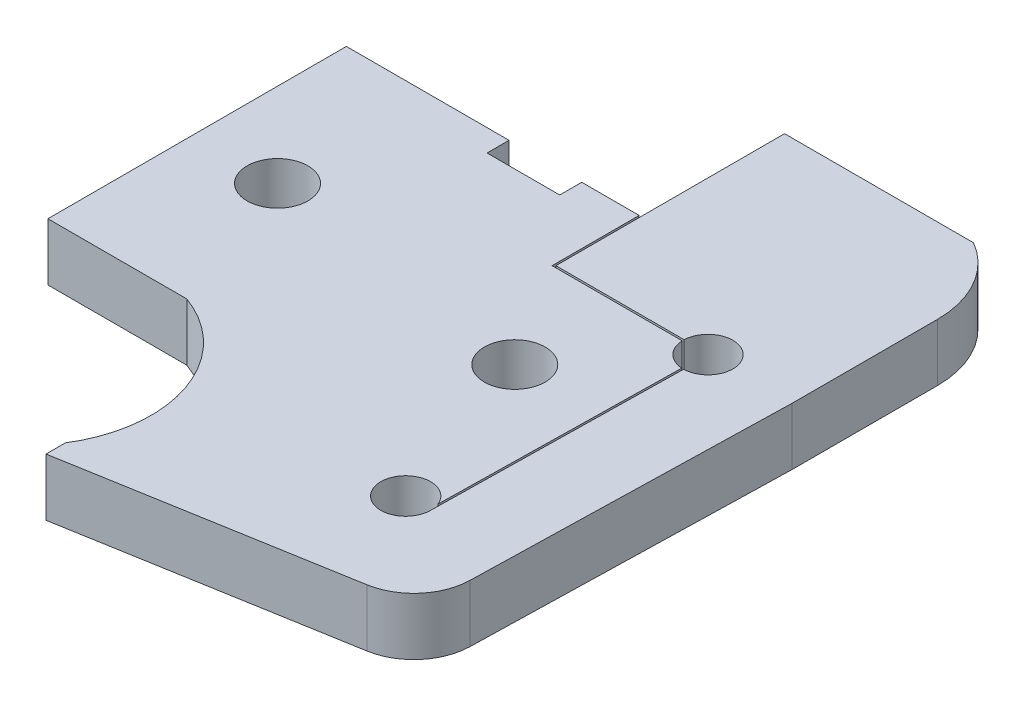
ISO-10303-21;
HEADER;
FILE_DESCRIPTION(('STEP AP214'),'2;1');
FILE_NAME('part.step','',(''),(''),'','','');
FILE_SCHEMA(('AUTOMOTIVE_DESIGN { 1 0 10303 214 1 1 1 1 }'));
ENDSEC;
DATA;
#1=APPLICATION_CONTEXT('core data for automotive mechanical design processes');
#2=APPLICATION_PROTOCOL_DEFINITION('international standard','automotive_design',2000,#1);
#3=PRODUCT_CONTEXT('',#1,'mechanical');
#4=PRODUCT('Part','Part','',(#3));
#5=PRODUCT_RELATED_PRODUCT_CATEGORY('part','',(#4));
#6=PRODUCT_DEFINITION_FORMATION('','',#4);
#7=PRODUCT_DEFINITION_CONTEXT('part definition',#1,'design');
#8=PRODUCT_DEFINITION('design','',#6,#7);
#9=PRODUCT_DEFINITION_SHAPE('','',#8);
#10=(LENGTH_UNIT() NAMED_UNIT(*) SI_UNIT(.MILLI.,.METRE.));
#11=(NAMED_UNIT(*) PLANE_ANGLE_UNIT() SI_UNIT($,.RADIAN.));
#12=(NAMED_UNIT(*) SI_UNIT($,.STERADIAN.) SOLID_ANGLE_UNIT());
#13=UNCERTAINTY_MEASURE_WITH_UNIT(LENGTH_MEASURE(1.E-05),#10,'distance_accuracy_value','');
#14=(GEOMETRIC_REPRESENTATION_CONTEXT(3) GLOBAL_UNCERTAINTY_ASSIGNED_CONTEXT((#13)) GLOBAL_UNIT_ASSIGNED_CONTEXT((#10,
#11,#12)) REPRESENTATION_CONTEXT('',''));
#15=CARTESIAN_POINT('',(0.,0.,0.));
#16=DIRECTION('',(0.,0.,1.));
#17=DIRECTION('',(1.,0.,0.));
#18=AXIS2_PLACEMENT_3D('',#15,#16,#17);
#19=CARTESIAN_POINT('',(-1.6,-1.5,-9.4));
#20=DIRECTION('',(-1.,0.,0.));
#21=DIRECTION('',(0.,0.,1.));
#22=AXIS2_PLACEMENT_3D('',#19,#20,#21);
#23=PLANE('',#22);
#24=DIRECTION('',(0.,1.,0.));
#25=VECTOR('',#24,1.);
#26=CARTESIAN_POINT('',(-1.6,-1.5,-9.4));
#27=LINE('',#26,#25);
#28=CARTESIAN_POINT('',(-1.6,-1.5,-9.4));
#29=VERTEX_POINT('',#28);
#30=CARTESIAN_POINT('',(-1.6,1.5,-9.4));
#31=VERTEX_POINT('',#30);
#32=EDGE_CURVE('E254',#29,#31,#27,.T.);
#33=ORIENTED_EDGE('',*,*,#32,.F.);
#34=DIRECTION('',(0.,0.,1.));
#35=VECTOR('',#34,1.);
#36=CARTESIAN_POINT('',(-1.6,-1.5,0.));
#37=LINE('',#36,#35);
#38=CARTESIAN_POINT('',(-1.6,-1.5,-8.25));
#39=VERTEX_POINT('',#38);
#40=EDGE_CURVE('E299',#29,#39,#37,.T.);
#41=ORIENTED_EDGE('',*,*,#40,.T.);
#42=DIRECTION('',(0.,1.,0.));
#43=VECTOR('',#42,1.);
#44=CARTESIAN_POINT('',(-1.6,-1.5,-8.25));
#45=LINE('',#44,#43);
#46=CARTESIAN_POINT('',(-1.6,1.5,-8.25));
#47=VERTEX_POINT('',#46);
#48=EDGE_CURVE('E330',#47,#39,#45,.F.);
#49=ORIENTED_EDGE('',*,*,#48,.F.);
#50=DIRECTION('',(0.,0.,1.));
#51=VECTOR('',#50,1.);
#52=CARTESIAN_POINT('',(-1.6,1.5,-9.4));
#53=LINE('',#52,#51);
#54=EDGE_CURVE('E315',#47,#31,#53,.F.);
#55=ORIENTED_EDGE('',*,*,#54,.T.);
#56=EDGE_LOOP('',(#33,#41,#49,#55));
#57=FACE_BOUND('',#56,.T.);
#58=ADVANCED_FACE('F17',(#57),#23,.T.);
#59=CARTESIAN_POINT('',(-5.4,-1.5,-8.25));
#60=DIRECTION('',(1.,0.,0.));
#61=DIRECTION('',(0.,0.,-1.));
#62=AXIS2_PLACEMENT_3D('',#59,#60,#61);
#63=PLANE('',#62);
#64=DIRECTION('',(0.,1.,0.));
#65=VECTOR('',#64,1.);
#66=CARTESIAN_POINT('',(-5.4,-1.5,-8.25));
#67=LINE('',#66,#65);
#68=CARTESIAN_POINT('',(-5.4,-1.5,-8.25));
#69=VERTEX_POINT('',#68);
#70=CARTESIAN_POINT('',(-5.4,1.5,-8.25));
#71=VERTEX_POINT('',#70);
#72=EDGE_CURVE('E325',#69,#71,#67,.T.);
#73=ORIENTED_EDGE('',*,*,#72,.F.);
#74=DIRECTION('',(0.,0.,1.));
#75=VECTOR('',#74,1.);
#76=CARTESIAN_POINT('',(-5.4,-1.5,0.));
#77=LINE('',#76,#75);
#78=CARTESIAN_POINT('',(-5.4,-1.5,-9.4));
#79=VERTEX_POINT('',#78);
#80=EDGE_CURVE('E233',#69,#79,#77,.F.);
#81=ORIENTED_EDGE('',*,*,#80,.T.);
#82=DIRECTION('',(0.,1.,0.));
#83=VECTOR('',#82,1.);
#84=CARTESIAN_POINT('',(-5.4,-1.5,-9.4));
#85=LINE('',#84,#83);
#86=CARTESIAN_POINT('',(-5.4,1.5,-9.4));
#87=VERTEX_POINT('',#86);
#88=EDGE_CURVE('E225',#87,#79,#85,.F.);
#89=ORIENTED_EDGE('',*,*,#88,.F.);
#90=DIRECTION('',(0.,0.,-1.));
#91=VECTOR('',#90,1.);
#92=CARTESIAN_POINT('',(-5.4,1.5,-8.25));
#93=LINE('',#92,#91);
#94=EDGE_CURVE('E300',#87,#71,#93,.F.);
#95=ORIENTED_EDGE('',*,*,#94,.T.);
#96=EDGE_LOOP('',(#73,#81,#89,#95));
#97=FACE_BOUND('',#96,.T.);
#98=ADVANCED_FACE('F699',(#97),#63,.T.);
#99=CARTESIAN_POINT('',(-3.3,-1.5,15.89284983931));
#100=DIRECTION('',(-1.,0.,0.));
#101=DIRECTION('',(0.,0.,1.));
#102=AXIS2_PLACEMENT_3D('',#99,#100,#101);
#103=PLANE('',#102);
#104=DIRECTION('',(0.,1.,0.));
#105=VECTOR('',#104,1.);
#106=CARTESIAN_POINT('',(-3.29999999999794,-1.5,15.8928498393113));
#107=LINE('',#106,#105);
#108=CARTESIAN_POINT('',(-3.29999999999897,1.5,15.8928498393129));
#109=VERTEX_POINT('',#108);
#110=CARTESIAN_POINT('',(-3.29999999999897,-1.5,15.8928498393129));
#111=VERTEX_POINT('',#110);
#112=EDGE_CURVE('E195',#109,#111,#107,.F.);
#113=ORIENTED_EDGE('',*,*,#112,.T.);
#114=DIRECTION('',(0.,0.,1.));
#115=VECTOR('',#114,1.);
#116=CARTESIAN_POINT('',(-3.3,-1.5,0.));
#117=LINE('',#116,#115);
#118=CARTESIAN_POINT('',(-3.3,-1.5,16.9));
#119=VERTEX_POINT('',#118);
#120=EDGE_CURVE('E172',#111,#119,#117,.T.);
#121=ORIENTED_EDGE('',*,*,#120,.T.);
#122=DIRECTION('',(0.,1.,0.));
#123=VECTOR('',#122,1.);
#124=CARTESIAN_POINT('',(-3.3,-1.5,16.9));
#125=LINE('',#124,#123);
#126=CARTESIAN_POINT('',(-3.3,1.5,16.9));
#127=VERTEX_POINT('',#126);
#128=EDGE_CURVE('E197',#127,#119,#125,.F.);
#129=ORIENTED_EDGE('',*,*,#128,.F.);
#130=DIRECTION('',(0.,0.,1.));
#131=VECTOR('',#130,1.);
#132=CARTESIAN_POINT('',(-3.3,1.5,15.89284983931));
#133=LINE('',#132,#131);
#134=EDGE_CURVE('E297',#127,#109,#133,.F.);
#135=ORIENTED_EDGE('',*,*,#134,.T.);
#136=EDGE_LOOP('',(#113,#121,#129,#135));
#137=FACE_BOUND('',#136,.T.);
#138=ADVANCED_FACE('F402',(#137),#103,.T.);
#139=CARTESIAN_POINT('',(0.,-1.5,0.));
#140=DIRECTION('',(0.,1.,0.));
#141=DIRECTION('',(0.,0.,1.));
#142=AXIS2_PLACEMENT_3D('',#139,#140,#141);
#143=PLANE('',#142);
#144=CARTESIAN_POINT('',(-9.5,-1.5,-1.4));
#145=DIRECTION('',(0.,1.,0.));
#146=DIRECTION('',(0.,0.,1.));
#147=AXIS2_PLACEMENT_3D('',#144,#145,#146);
#148=CIRCLE('',#147,1.59);
#149=CARTESIAN_POINT('',(-9.5,-1.5,0.19));
#150=VERTEX_POINT('',#149);
#151=EDGE_CURVE('E373',#150,#150,#148,.T.);
#152=ORIENTED_EDGE('',*,*,#151,.T.);
#153=EDGE_LOOP('',(#152));
#154=FACE_BOUND('',#153,.T.);
#155=CARTESIAN_POINT('',(4.9,-1.5,0.6));
#156=DIRECTION('',(0.,1.,0.));
#157=DIRECTION('',(0.,0.,1.));
#158=AXIS2_PLACEMENT_3D('',#155,#156,#157);
#159=CIRCLE('',#158,1.59);
#160=CARTESIAN_POINT('',(4.9,-1.5,2.19));
#161=VERTEX_POINT('',#160);
#162=EDGE_CURVE('E249',#161,#161,#159,.T.);
#163=ORIENTED_EDGE('',*,*,#162,.T.);
#164=EDGE_LOOP('',(#163));
#165=FACE_BOUND('',#164,.T.);
#166=CARTESIAN_POINT('',(9.5,-1.5,-4.9));
#167=DIRECTION('',(0.,1.,0.));
#168=DIRECTION('',(0.,0.,1.));
#169=AXIS2_PLACEMENT_3D('',#166,#167,#168);
#170=CIRCLE('',#169,1.3);
#171=CARTESIAN_POINT('',(8.20096189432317,-1.5,-4.85));
#172=VERTEX_POINT('',#171);
#173=CARTESIAN_POINT('',(9.427317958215,-1.5,-3.60203338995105));
#174=VERTEX_POINT('',#173);
#175=EDGE_CURVE('E378',#172,#174,#170,.T.);
#176=ORIENTED_EDGE('',*,*,#175,.T.);
#177=DIRECTION('',(-0.0174665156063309,0.,0.99984744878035));
#178=VECTOR('',#177,1.);
#179=CARTESIAN_POINT('',(9.427317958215,-1.5,-3.602033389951));
#180=LINE('',#179,#178);
#181=CARTESIAN_POINT('',(9.20855019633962,-1.5,8.92103609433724));
#182=VERTEX_POINT('',#181);
#183=EDGE_CURVE('E257',#174,#182,#180,.T.);
#184=ORIENTED_EDGE('',*,*,#183,.T.);
#185=CARTESIAN_POINT('',(8.,-1.5,9.4));
#186=DIRECTION('',(0.,1.,0.));
#187=DIRECTION('',(0.,0.,1.));
#188=AXIS2_PLACEMENT_3D('',#185,#186,#187);
#189=CIRCLE('',#188,1.3);
#190=CARTESIAN_POINT('',(9.29980168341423,-1.5,9.42270647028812));
#191=VERTEX_POINT('',#190);
#192=EDGE_CURVE('E380',#182,#191,#189,.T.);
#193=ORIENTED_EDGE('',*,*,#192,.T.);
#194=DIRECTION('',(0.0174665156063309,0.,-0.99984744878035));
#195=VECTOR('',#194,1.);
#196=CARTESIAN_POINT('',(9.299801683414,-1.5,9.422706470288));
#197=LINE('',#196,#195);
#198=CARTESIAN_POINT('',(9.52730270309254,-1.5,-3.60028673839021));
#199=VERTEX_POINT('',#198);
#200=EDGE_CURVE('E261',#191,#199,#197,.T.);
#201=ORIENTED_EDGE('',*,*,#200,.T.);
#202=CARTESIAN_POINT('',(9.5,-1.5,-4.9));
#203=DIRECTION('',(0.,1.,0.));
#204=DIRECTION('',(0.,0.,1.));
#205=AXIS2_PLACEMENT_3D('',#202,#203,#204);
#206=CIRCLE('',#205,1.3);
#207=CARTESIAN_POINT('',(8.20096189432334,-1.5,-4.94999999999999));
#208=VERTEX_POINT('',#207);
#209=EDGE_CURVE('E382',#199,#208,#206,.T.);
#210=ORIENTED_EDGE('',*,*,#209,.T.);
#211=DIRECTION('',(-1.,0.,0.));
#212=VECTOR('',#211,1.);
#213=CARTESIAN_POINT('',(8.200961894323,-1.5,-4.95));
#214=LINE('',#213,#212);
#215=CARTESIAN_POINT('',(1.5,-1.5,-4.95));
#216=VERTEX_POINT('',#215);
#217=EDGE_CURVE('E265',#208,#216,#214,.T.);
#218=ORIENTED_EDGE('',*,*,#217,.T.);
#219=DIRECTION('',(0.,0.,1.));
#220=VECTOR('',#219,1.);
#221=CARTESIAN_POINT('',(1.5,-1.5,-16.9));
#222=LINE('',#221,#220);
#223=CARTESIAN_POINT('',(1.5,-1.5,-16.9));
#224=VERTEX_POINT('',#223);
#225=EDGE_CURVE('E268',#224,#216,#222,.T.);
#226=ORIENTED_EDGE('',*,*,#225,.F.);
#227=DIRECTION('',(-1.,0.,0.));
#228=VECTOR('',#227,1.);
#229=CARTESIAN_POINT('',(11.37875939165,-1.5,-16.9));
#230=LINE('',#229,#228);
#231=CARTESIAN_POINT('',(11.3787593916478,-1.5,-16.9));
#232=VERTEX_POINT('',#231);
#233=EDGE_CURVE('E276',#232,#224,#230,.T.);
#234=ORIENTED_EDGE('',*,*,#233,.F.);
#235=CARTESIAN_POINT('',(8.8,-1.5,-12.5));
#236=DIRECTION('',(0.,1.,0.));
#237=DIRECTION('',(0.,0.,1.));
#238=AXIS2_PLACEMENT_3D('',#235,#236,#237);
#239=CIRCLE('',#238,5.1);
#240=CARTESIAN_POINT('',(13.9,-1.5,-12.5));
#241=VERTEX_POINT('',#240);
#242=EDGE_CURVE('E384',#241,#232,#239,.T.);
#243=ORIENTED_EDGE('',*,*,#242,.F.);
#244=DIRECTION('',(0.,0.,-1.));
#245=VECTOR('',#244,1.);
#246=CARTESIAN_POINT('',(13.9,-1.5,-4.9));
#247=LINE('',#246,#245);
#248=CARTESIAN_POINT('',(13.9000000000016,-1.5,-4.89999999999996));
#249=VERTEX_POINT('',#248);
#250=EDGE_CURVE('E281',#249,#241,#247,.T.);
#251=ORIENTED_EDGE('',*,*,#250,.F.);
#252=DIRECTION('',(0.0244321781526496,0.,-0.999701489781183));
#253=VECTOR('',#252,1.);
#254=CARTESIAN_POINT('',(13.49808370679,-1.5,11.54537439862));
#255=LINE('',#254,#253);
#256=CARTESIAN_POINT('',(13.49808370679,-1.5,11.5453743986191));
#257=VERTEX_POINT('',#256);
#258=EDGE_CURVE('E287',#257,#249,#255,.T.);
#259=ORIENTED_EDGE('',*,*,#258,.F.);
#260=CARTESIAN_POINT('',(10.49897923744,-1.5,11.47207786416));
#261=DIRECTION('',(0.,1.,0.));
#262=DIRECTION('',(0.,0.,1.));
#263=AXIS2_PLACEMENT_3D('',#260,#261,#262);
#264=CIRCLE('',#263,3.);
#265=CARTESIAN_POINT('',(11.0096077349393,-1.5,14.428301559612));
#266=VERTEX_POINT('',#265);
#267=EDGE_CURVE('E385',#266,#257,#264,.T.);
#268=ORIENTED_EDGE('',*,*,#267,.F.);
#269=DIRECTION('',(0.985407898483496,0.,-0.170209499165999));
#270=VECTOR('',#269,1.);
#271=CARTESIAN_POINT('',(-3.3,-1.5,16.9));
#272=LINE('',#271,#270);
#273=EDGE_CURVE('E292',#119,#266,#272,.T.);
#274=ORIENTED_EDGE('',*,*,#273,.F.);
#275=ORIENTED_EDGE('',*,*,#120,.F.);
#276=CARTESIAN_POINT('',(-8.9,-1.5,12.4));
#277=DIRECTION('',(0.,1.,0.));
#278=DIRECTION('',(0.,0.,1.));
#279=AXIS2_PLACEMENT_3D('',#276,#277,#278);
#280=CIRCLE('',#279,6.6);
#281=CARTESIAN_POINT('',(-6.63725830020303,-1.5,6.20000000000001));
#282=VERTEX_POINT('',#281);
#283=EDGE_CURVE('E20',#111,#282,#280,.T.);
#284=ORIENTED_EDGE('',*,*,#283,.T.);
#285=DIRECTION('',(1.,0.,0.));
#286=VECTOR('',#285,1.);
#287=CARTESIAN_POINT('',(-13.9,-1.5,6.2));
#288=LINE('',#287,#286);
#289=CARTESIAN_POINT('',(-13.9,-1.5,6.2));
#290=VERTEX_POINT('',#289);
#291=EDGE_CURVE('E179',#290,#282,#288,.T.);
#292=ORIENTED_EDGE('',*,*,#291,.F.);
#293=DIRECTION('',(0.,0.,1.));
#294=VECTOR('',#293,1.);
#295=CARTESIAN_POINT('',(-13.9,-1.5,-9.4));
#296=LINE('',#295,#294);
#297=CARTESIAN_POINT('',(-13.9,-1.5,-9.4));
#298=VERTEX_POINT('',#297);
#299=EDGE_CURVE('E204',#298,#290,#296,.T.);
#300=ORIENTED_EDGE('',*,*,#299,.F.);
#301=DIRECTION('',(-1.,0.,0.));
#302=VECTOR('',#301,1.);
#303=CARTESIAN_POINT('',(-5.4,-1.5,-9.4));
#304=LINE('',#303,#302);
#305=EDGE_CURVE('E217',#79,#298,#304,.T.);
#306=ORIENTED_EDGE('',*,*,#305,.F.);
#307=ORIENTED_EDGE('',*,*,#80,.F.);
#308=DIRECTION('',(-1.,0.,0.));
#309=VECTOR('',#308,1.);
#310=CARTESIAN_POINT('',(-1.6,-1.5,-8.25));
#311=LINE('',#310,#309);
#312=EDGE_CURVE('E228',#39,#69,#311,.T.);
#313=ORIENTED_EDGE('',*,*,#312,.F.);
#314=ORIENTED_EDGE('',*,*,#40,.F.);
#315=DIRECTION('',(-1.,0.,0.));
#316=VECTOR('',#315,1.);
#317=CARTESIAN_POINT('',(1.5,-1.5,-9.4));
#318=LINE('',#317,#316);
#319=CARTESIAN_POINT('',(1.4,-1.5,-9.4));
#320=VERTEX_POINT('',#319);
#321=EDGE_CURVE('E232',#320,#29,#318,.T.);
#322=ORIENTED_EDGE('',*,*,#321,.F.);
#323=DIRECTION('',(0.,0.,1.));
#324=VECTOR('',#323,1.);
#325=CARTESIAN_POINT('',(1.4,-1.5,-9.4));
#326=LINE('',#325,#324);
#327=CARTESIAN_POINT('',(1.4,-1.5,-4.85));
#328=VERTEX_POINT('',#327);
#329=EDGE_CURVE('E242',#320,#328,#326,.T.);
#330=ORIENTED_EDGE('',*,*,#329,.T.);
#331=DIRECTION('',(1.,0.,0.));
#332=VECTOR('',#331,1.);
#333=CARTESIAN_POINT('',(1.4,-1.5,-4.85));
#334=LINE('',#333,#332);
#335=EDGE_CURVE('E236',#328,#172,#334,.T.);
#336=ORIENTED_EDGE('',*,*,#335,.T.);
#337=EDGE_LOOP('',(#176,#184,#193,#201,#210,#218,#226,#234,#243,#251,#259,#268,#274,#275,#284,
#292,#300,#306,#307,#313,#314,#322,#330,#336));
#338=FACE_BOUND('',#337,.T.);
#339=ADVANCED_FACE('F177',(#154,#165,#338),#143,.F.);
#340=CARTESIAN_POINT('',(1.5,-1.5,-9.4));
#341=DIRECTION('',(0.,0.,-1.));
#342=DIRECTION('',(-1.,0.,0.));
#343=AXIS2_PLACEMENT_3D('',#340,#341,#342);
#344=PLANE('',#343);
#345=DIRECTION('',(1.,0.,0.));
#346=VECTOR('',#345,1.);
#347=CARTESIAN_POINT('',(0.,1.5,-9.4));
#348=LINE('',#347,#346);
#349=CARTESIAN_POINT('',(1.4,1.5,-9.4));
#350=VERTEX_POINT('',#349);
#351=EDGE_CURVE('E343',#350,#31,#348,.F.);
#352=ORIENTED_EDGE('',*,*,#351,.F.);
#353=DIRECTION('',(0.,1.,0.));
#354=VECTOR('',#353,1.);
#355=CARTESIAN_POINT('',(1.4,1.5,-9.4));
#356=LINE('',#355,#354);
#357=EDGE_CURVE('E246',#350,#320,#356,.F.);
#358=ORIENTED_EDGE('',*,*,#357,.T.);
#359=ORIENTED_EDGE('',*,*,#321,.T.);
#360=ORIENTED_EDGE('',*,*,#32,.T.);
#361=EDGE_LOOP('',(#352,#358,#359,#360));
#362=FACE_BOUND('',#361,.T.);
#363=ADVANCED_FACE('F677',(#362),#344,.T.);
#364=CARTESIAN_POINT('',(-1.6,-1.5,-8.25));
#365=DIRECTION('',(0.,0.,-1.));
#366=DIRECTION('',(-1.,0.,0.));
#367=AXIS2_PLACEMENT_3D('',#364,#365,#366);
#368=PLANE('',#367);
#369=ORIENTED_EDGE('',*,*,#48,.T.);
#370=ORIENTED_EDGE('',*,*,#312,.T.);
#371=ORIENTED_EDGE('',*,*,#72,.T.);
#372=DIRECTION('',(1.,0.,0.));
#373=VECTOR('',#372,1.);
#374=CARTESIAN_POINT('',(0.,1.5,-8.25));
#375=LINE('',#374,#373);
#376=EDGE_CURVE('E222',#47,#71,#375,.F.);
#377=ORIENTED_EDGE('',*,*,#376,.F.);
#378=EDGE_LOOP('',(#369,#370,#371,#377));
#379=FACE_BOUND('',#378,.T.);
#380=ADVANCED_FACE('F669',(#379),#368,.T.);
#381=CARTESIAN_POINT('',(-5.4,-1.5,-9.4));
#382=DIRECTION('',(0.,0.,-1.));
#383=DIRECTION('',(-1.,0.,0.));
#384=AXIS2_PLACEMENT_3D('',#381,#382,#383);
#385=PLANE('',#384);
#386=ORIENTED_EDGE('',*,*,#88,.T.);
#387=ORIENTED_EDGE('',*,*,#305,.T.);
#388=DIRECTION('',(0.,1.,0.));
#389=VECTOR('',#388,1.);
#390=CARTESIAN_POINT('',(-13.9,-1.5,-9.4));
#391=LINE('',#390,#389);
#392=CARTESIAN_POINT('',(-13.9,1.5,-9.4));
#393=VERTEX_POINT('',#392);
#394=EDGE_CURVE('E214',#393,#298,#391,.F.);
#395=ORIENTED_EDGE('',*,*,#394,.F.);
#396=DIRECTION('',(1.,0.,0.));
#397=VECTOR('',#396,1.);
#398=CARTESIAN_POINT('',(0.,1.5,-9.4));
#399=LINE('',#398,#397);
#400=EDGE_CURVE('E211',#87,#393,#399,.F.);
#401=ORIENTED_EDGE('',*,*,#400,.F.);
#402=EDGE_LOOP('',(#386,#387,#395,#401));
#403=FACE_BOUND('',#402,.T.);
#404=ADVANCED_FACE('F661',(#403),#385,.T.);
#405=CARTESIAN_POINT('',(-13.9,-1.5,-9.4));
#406=DIRECTION('',(-1.,0.,0.));
#407=DIRECTION('',(0.,0.,1.));
#408=AXIS2_PLACEMENT_3D('',#405,#406,#407);
#409=PLANE('',#408);
#410=ORIENTED_EDGE('',*,*,#394,.T.);
#411=ORIENTED_EDGE('',*,*,#299,.T.);
#412=DIRECTION('',(0.,1.,0.));
#413=VECTOR('',#412,1.);
#414=CARTESIAN_POINT('',(-13.9,-1.5,6.2));
#415=LINE('',#414,#413);
#416=CARTESIAN_POINT('',(-13.9,1.5,6.2));
#417=VERTEX_POINT('',#416);
#418=EDGE_CURVE('E189',#417,#290,#415,.F.);
#419=ORIENTED_EDGE('',*,*,#418,.F.);
#420=DIRECTION('',(0.,0.,1.));
#421=VECTOR('',#420,1.);
#422=CARTESIAN_POINT('',(-13.9,1.5,0.));
#423=LINE('',#422,#421);
#424=EDGE_CURVE('E207',#393,#417,#423,.T.);
#425=ORIENTED_EDGE('',*,*,#424,.F.);
#426=EDGE_LOOP('',(#410,#411,#419,#425));
#427=FACE_BOUND('',#426,.T.);
#428=ADVANCED_FACE('F654',(#427),#409,.T.);
#429=CARTESIAN_POINT('',(-13.9,-1.5,6.2));
#430=DIRECTION('',(0.,0.,1.));
#431=DIRECTION('',(1.,0.,0.));
#432=AXIS2_PLACEMENT_3D('',#429,#430,#431);
#433=PLANE('',#432);
#434=ORIENTED_EDGE('',*,*,#418,.T.);
#435=ORIENTED_EDGE('',*,*,#291,.T.);
#436=DIRECTION('',(0.,1.,0.));
#437=VECTOR('',#436,1.);
#438=CARTESIAN_POINT('',(-6.63725830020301,-1.5,6.20000000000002));
#439=LINE('',#438,#437);
#440=CARTESIAN_POINT('',(-6.63725830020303,1.5,6.20000000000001));
#441=VERTEX_POINT('',#440);
#442=EDGE_CURVE('E184',#282,#441,#439,.T.);
#443=ORIENTED_EDGE('',*,*,#442,.T.);
#444=DIRECTION('',(1.,0.,0.));
#445=VECTOR('',#444,1.);
#446=CARTESIAN_POINT('',(0.,1.5,6.2));
#447=LINE('',#446,#445);
#448=EDGE_CURVE('E210',#417,#441,#447,.T.);
#449=ORIENTED_EDGE('',*,*,#448,.F.);
#450=EDGE_LOOP('',(#434,#435,#443,#449));
#451=FACE_BOUND('',#450,.T.);
#452=ADVANCED_FACE('F186',(#451),#433,.T.);
#453=CARTESIAN_POINT('',(-8.9,-1.5,12.4));
#454=DIRECTION('',(0.,1.,0.));
#455=DIRECTION('',(0.,0.,1.));
#456=AXIS2_PLACEMENT_3D('',#453,#454,#455);
#457=CYLINDRICAL_SURFACE('',#456,6.6);
#458=CARTESIAN_POINT('',(-8.9,1.5,12.4));
#459=DIRECTION('',(0.,1.,0.));
#460=DIRECTION('',(0.,0.,1.));
#461=AXIS2_PLACEMENT_3D('',#458,#459,#460);
#462=CIRCLE('',#461,6.6);
#463=EDGE_CURVE('E193',#441,#109,#462,.F.);
#464=ORIENTED_EDGE('',*,*,#463,.F.);
#465=ORIENTED_EDGE('',*,*,#442,.F.);
#466=ORIENTED_EDGE('',*,*,#283,.F.);
#467=ORIENTED_EDGE('',*,*,#112,.F.);
#468=EDGE_LOOP('',(#464,#465,#466,#467));
#469=FACE_BOUND('',#468,.T.);
#470=ADVANCED_FACE('F191',(#469),#457,.F.);
#471=CARTESIAN_POINT('',(-3.3,-1.5,16.9));
#472=DIRECTION('',(0.170209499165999,0.,0.985407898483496));
#473=DIRECTION('',(0.985407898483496,0.,-0.170209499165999));
#474=AXIS2_PLACEMENT_3D('',#471,#472,#473);
#475=PLANE('',#474);
#476=ORIENTED_EDGE('',*,*,#128,.T.);
#477=ORIENTED_EDGE('',*,*,#273,.T.);
#478=DIRECTION('',(0.,1.,0.));
#479=VECTOR('',#478,1.);
#480=CARTESIAN_POINT('',(11.00960773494,-1.5,14.4283015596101));
#481=LINE('',#480,#479);
#482=CARTESIAN_POINT('',(11.0096077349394,1.5,14.4283015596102));
#483=VERTEX_POINT('',#482);
#484=EDGE_CURVE('E294',#483,#266,#481,.F.);
#485=ORIENTED_EDGE('',*,*,#484,.F.);
#486=DIRECTION('',(0.985407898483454,0.,-0.170209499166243));
#487=VECTOR('',#486,1.);
#488=CARTESIAN_POINT('',(-3.3,1.5,16.9));
#489=LINE('',#488,#487);
#490=EDGE_CURVE('E371',#127,#483,#489,.T.);
#491=ORIENTED_EDGE('',*,*,#490,.F.);
#492=EDGE_LOOP('',(#476,#477,#485,#491));
#493=FACE_BOUND('',#492,.T.);
#494=ADVANCED_FACE('F399',(#493),#475,.T.);
#495=CARTESIAN_POINT('',(10.49897923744,-1.5,11.47207786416));
#496=DIRECTION('',(0.,1.,0.));
#497=DIRECTION('',(0.,0.,1.));
#498=AXIS2_PLACEMENT_3D('',#495,#496,#497);
#499=CYLINDRICAL_SURFACE('',#498,3.);
#500=ORIENTED_EDGE('',*,*,#484,.T.);
#501=ORIENTED_EDGE('',*,*,#267,.T.);
#502=DIRECTION('',(0.,1.,0.));
#503=VECTOR('',#502,1.);
#504=CARTESIAN_POINT('',(13.49808370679,-1.5,11.54537439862));
#505=LINE('',#504,#503);
#506=CARTESIAN_POINT('',(13.49808370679,1.5,11.5453743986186));
#507=VERTEX_POINT('',#506);
#508=EDGE_CURVE('E289',#507,#257,#505,.F.);
#509=ORIENTED_EDGE('',*,*,#508,.F.);
#510=CARTESIAN_POINT('',(10.49897923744,1.5,11.47207786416));
#511=DIRECTION('',(0.,1.,0.));
#512=DIRECTION('',(0.,0.,1.));
#513=AXIS2_PLACEMENT_3D('',#510,#511,#512);
#514=CIRCLE('',#513,3.);
#515=EDGE_CURVE('E367',#483,#507,#514,.T.);
#516=ORIENTED_EDGE('',*,*,#515,.F.);
#517=EDGE_LOOP('',(#500,#501,#509,#516));
#518=FACE_BOUND('',#517,.T.);
#519=ADVANCED_FACE('F410',(#518),#499,.T.);
#520=CARTESIAN_POINT('',(13.49808370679,-1.5,11.54537439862));
#521=DIRECTION('',(0.999701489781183,0.,0.0244321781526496));
#522=DIRECTION('',(0.0244321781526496,0.,-0.999701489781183));
#523=AXIS2_PLACEMENT_3D('',#520,#521,#522);
#524=PLANE('',#523);
#525=ORIENTED_EDGE('',*,*,#508,.T.);
#526=ORIENTED_EDGE('',*,*,#258,.T.);
#527=DIRECTION('',(0.,1.,0.));
#528=VECTOR('',#527,1.);
#529=CARTESIAN_POINT('',(13.9,-1.5,-4.9));
#530=LINE('',#529,#528);
#531=CARTESIAN_POINT('',(13.9,1.5,-4.9000000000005));
#532=VERTEX_POINT('',#531);
#533=EDGE_CURVE('E284',#532,#249,#530,.F.);
#534=ORIENTED_EDGE('',*,*,#533,.F.);
#535=DIRECTION('',(0.0244321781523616,0.,-0.99970148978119));
#536=VECTOR('',#535,1.);
#537=CARTESIAN_POINT('',(13.49808370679,1.5,11.54537439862));
#538=LINE('',#537,#536);
#539=EDGE_CURVE('E370',#507,#532,#538,.T.);
#540=ORIENTED_EDGE('',*,*,#539,.F.);
#541=EDGE_LOOP('',(#525,#526,#534,#540));
#542=FACE_BOUND('',#541,.T.);
#543=ADVANCED_FACE('F408',(#542),#524,.T.);
#544=CARTESIAN_POINT('',(13.9,-1.5,-4.9));
#545=DIRECTION('',(1.,0.,0.));
#546=DIRECTION('',(0.,0.,-1.));
#547=AXIS2_PLACEMENT_3D('',#544,#545,#546);
#548=PLANE('',#547);
#549=ORIENTED_EDGE('',*,*,#533,.T.);
#550=ORIENTED_EDGE('',*,*,#250,.T.);
#551=DIRECTION('',(0.,1.,0.));
#552=VECTOR('',#551,1.);
#553=CARTESIAN_POINT('',(13.9,-1.5,-12.5));
#554=LINE('',#553,#552);
#555=CARTESIAN_POINT('',(13.9,1.5,-12.5));
#556=VERTEX_POINT('',#555);
#557=EDGE_CURVE('E283',#556,#241,#554,.F.);
#558=ORIENTED_EDGE('',*,*,#557,.F.);
#559=DIRECTION('',(0.,0.,1.));
#560=VECTOR('',#559,1.);
#561=CARTESIAN_POINT('',(13.9,1.5,0.));
#562=LINE('',#561,#560);
#563=EDGE_CURVE('E366',#532,#556,#562,.F.);
#564=ORIENTED_EDGE('',*,*,#563,.F.);
#565=EDGE_LOOP('',(#549,#550,#558,#564));
#566=FACE_BOUND('',#565,.T.);
#567=ADVANCED_FACE('F458',(#566),#548,.T.);
#568=CARTESIAN_POINT('',(8.8,-1.5,-12.5));
#569=DIRECTION('',(0.,1.,0.));
#570=DIRECTION('',(0.,0.,1.));
#571=AXIS2_PLACEMENT_3D('',#568,#569,#570);
#572=CYLINDRICAL_SURFACE('',#571,5.1);
#573=ORIENTED_EDGE('',*,*,#557,.T.);
#574=ORIENTED_EDGE('',*,*,#242,.T.);
#575=DIRECTION('',(0.,1.,0.));
#576=VECTOR('',#575,1.);
#577=CARTESIAN_POINT('',(11.37875939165,-1.5,-16.9));
#578=LINE('',#577,#576);
#579=CARTESIAN_POINT('',(11.3787593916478,1.5,-16.9));
#580=VERTEX_POINT('',#579);
#581=EDGE_CURVE('E278',#580,#232,#578,.F.);
#582=ORIENTED_EDGE('',*,*,#581,.F.);
#583=CARTESIAN_POINT('',(8.8,1.5,-12.5));
#584=DIRECTION('',(0.,1.,0.));
#585=DIRECTION('',(0.,0.,1.));
#586=AXIS2_PLACEMENT_3D('',#583,#584,#585);
#587=CIRCLE('',#586,5.1);
#588=EDGE_CURVE('E362',#556,#580,#587,.T.);
#589=ORIENTED_EDGE('',*,*,#588,.F.);
#590=EDGE_LOOP('',(#573,#574,#582,#589));
#591=FACE_BOUND('',#590,.T.);
#592=ADVANCED_FACE('F520',(#591),#572,.T.);
#593=CARTESIAN_POINT('',(11.37875939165,-1.5,-16.9));
#594=DIRECTION('',(0.,0.,-1.));
#595=DIRECTION('',(-1.,0.,0.));
#596=AXIS2_PLACEMENT_3D('',#593,#594,#595);
#597=PLANE('',#596);
#598=ORIENTED_EDGE('',*,*,#581,.T.);
#599=ORIENTED_EDGE('',*,*,#233,.T.);
#600=DIRECTION('',(0.,1.,0.));
#601=VECTOR('',#600,1.);
#602=CARTESIAN_POINT('',(1.5,-1.5,-16.9));
#603=LINE('',#602,#601);
#604=CARTESIAN_POINT('',(1.5,1.5,-16.9));
#605=VERTEX_POINT('',#604);
#606=EDGE_CURVE('E273',#605,#224,#603,.F.);
#607=ORIENTED_EDGE('',*,*,#606,.F.);
#608=DIRECTION('',(1.,0.,0.));
#609=VECTOR('',#608,1.);
#610=CARTESIAN_POINT('',(0.,1.5,-16.9));
#611=LINE('',#610,#609);
#612=EDGE_CURVE('E365',#580,#605,#611,.F.);
#613=ORIENTED_EDGE('',*,*,#612,.F.);
#614=EDGE_LOOP('',(#598,#599,#607,#613));
#615=FACE_BOUND('',#614,.T.);
#616=ADVANCED_FACE('F518',(#615),#597,.T.);
#617=CARTESIAN_POINT('',(1.5,-1.5,-16.9));
#618=DIRECTION('',(-1.,0.,0.));
#619=DIRECTION('',(0.,0.,1.));
#620=AXIS2_PLACEMENT_3D('',#617,#618,#619);
#621=PLANE('',#620);
#622=DIRECTION('',(0.,1.,0.));
#623=VECTOR('',#622,1.);
#624=CARTESIAN_POINT('',(1.5,1.5,-4.95));
#625=LINE('',#624,#623);
#626=CARTESIAN_POINT('',(1.5,1.5,-4.95));
#627=VERTEX_POINT('',#626);
#628=EDGE_CURVE('E267',#216,#627,#625,.T.);
#629=ORIENTED_EDGE('',*,*,#628,.T.);
#630=DIRECTION('',(0.,0.,1.));
#631=VECTOR('',#630,1.);
#632=CARTESIAN_POINT('',(1.5,1.5,0.));
#633=LINE('',#632,#631);
#634=EDGE_CURVE('E442',#605,#627,#633,.T.);
#635=ORIENTED_EDGE('',*,*,#634,.F.);
#636=ORIENTED_EDGE('',*,*,#606,.T.);
#637=ORIENTED_EDGE('',*,*,#225,.T.);
#638=EDGE_LOOP('',(#629,#635,#636,#637));
#639=FACE_BOUND('',#638,.T.);
#640=ADVANCED_FACE('F514',(#639),#621,.T.);
#641=CARTESIAN_POINT('',(8.200961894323,1.5,-4.95));
#642=DIRECTION('',(0.,0.,-1.));
#643=DIRECTION('',(-1.,0.,0.));
#644=AXIS2_PLACEMENT_3D('',#641,#642,#643);
#645=PLANE('',#644);
#646=DIRECTION('',(1.,0.,0.));
#647=VECTOR('',#646,1.);
#648=CARTESIAN_POINT('',(0.,1.5,-4.95));
#649=LINE('',#648,#647);
#650=CARTESIAN_POINT('',(8.20096189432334,1.5,-4.94999999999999));
#651=VERTEX_POINT('',#650);
#652=EDGE_CURVE('E361',#627,#651,#649,.T.);
#653=ORIENTED_EDGE('',*,*,#652,.F.);
#654=ORIENTED_EDGE('',*,*,#628,.F.);
#655=ORIENTED_EDGE('',*,*,#217,.F.);
#656=DIRECTION('',(0.,1.,0.));
#657=VECTOR('',#656,1.);
#658=CARTESIAN_POINT('',(8.20096189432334,1.5,-4.94999999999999));
#659=LINE('',#658,#657);
#660=EDGE_CURVE('E264',#208,#651,#659,.T.);
#661=ORIENTED_EDGE('',*,*,#660,.T.);
#662=EDGE_LOOP('',(#653,#654,#655,#661));
#663=FACE_BOUND('',#662,.T.);
#664=ADVANCED_FACE('F511',(#663),#645,.F.);
#665=CARTESIAN_POINT('',(9.5,1.5,-4.9));
#666=DIRECTION('',(0.,1.,0.));
#667=DIRECTION('',(0.,0.,1.));
#668=AXIS2_PLACEMENT_3D('',#665,#666,#667);
#669=CYLINDRICAL_SURFACE('',#668,1.3);
#670=CARTESIAN_POINT('',(9.5,1.5,-4.9));
#671=DIRECTION('',(0.,1.,0.));
#672=DIRECTION('',(0.,0.,1.));
#673=AXIS2_PLACEMENT_3D('',#670,#671,#672);
#674=CIRCLE('',#673,1.3);
#675=CARTESIAN_POINT('',(9.52730270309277,1.5,-3.60028673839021));
#676=VERTEX_POINT('',#675);
#677=EDGE_CURVE('E358',#651,#676,#674,.F.);
#678=ORIENTED_EDGE('',*,*,#677,.F.);
#679=ORIENTED_EDGE('',*,*,#660,.F.);
#680=ORIENTED_EDGE('',*,*,#209,.F.);
#681=DIRECTION('',(0.,1.,0.));
#682=VECTOR('',#681,1.);
#683=CARTESIAN_POINT('',(9.52730270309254,1.5,-3.60028673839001));
#684=LINE('',#683,#682);
#685=EDGE_CURVE('E263',#199,#676,#684,.T.);
#686=ORIENTED_EDGE('',*,*,#685,.T.);
#687=EDGE_LOOP('',(#678,#679,#680,#686));
#688=FACE_BOUND('',#687,.T.);
#689=ADVANCED_FACE('F504',(#688),#669,.F.);
#690=CARTESIAN_POINT('',(9.299801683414,1.5,9.422706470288));
#691=DIRECTION('',(0.99984744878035,0.,0.0174665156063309));
#692=DIRECTION('',(0.0174665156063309,0.,-0.99984744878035));
#693=AXIS2_PLACEMENT_3D('',#690,#691,#692);
#694=PLANE('',#693);
#695=DIRECTION('',(-0.0174665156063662,0.,0.999847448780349));
#696=VECTOR('',#695,1.);
#697=CARTESIAN_POINT('',(9.527302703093,1.5,-3.60028673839));
#698=LINE('',#697,#696);
#699=CARTESIAN_POINT('',(9.29980168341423,1.5,9.42270647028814));
#700=VERTEX_POINT('',#699);
#701=EDGE_CURVE('E357',#676,#700,#698,.T.);
#702=ORIENTED_EDGE('',*,*,#701,.F.);
#703=ORIENTED_EDGE('',*,*,#685,.F.);
#704=ORIENTED_EDGE('',*,*,#200,.F.);
#705=DIRECTION('',(0.,1.,0.));
#706=VECTOR('',#705,1.);
#707=CARTESIAN_POINT('',(9.29980168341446,1.5,9.42270647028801));
#708=LINE('',#707,#706);
#709=EDGE_CURVE('E260',#191,#700,#708,.T.);
#710=ORIENTED_EDGE('',*,*,#709,.T.);
#711=EDGE_LOOP('',(#702,#703,#704,#710));
#712=FACE_BOUND('',#711,.T.);
#713=ADVANCED_FACE('F501',(#712),#694,.F.);
#714=CARTESIAN_POINT('',(8.,1.5,9.4));
#715=DIRECTION('',(0.,1.,0.));
#716=DIRECTION('',(0.,0.,1.));
#717=AXIS2_PLACEMENT_3D('',#714,#715,#716);
#718=CYLINDRICAL_SURFACE('',#717,1.3);
#719=CARTESIAN_POINT('',(8.,1.5,9.4));
#720=DIRECTION('',(0.,1.,0.));
#721=DIRECTION('',(0.,0.,1.));
#722=AXIS2_PLACEMENT_3D('',#719,#720,#721);
#723=CIRCLE('',#722,1.3);
#724=CARTESIAN_POINT('',(9.2085501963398,1.5,8.9210360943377));
#725=VERTEX_POINT('',#724);
#726=EDGE_CURVE('E354',#700,#725,#723,.F.);
#727=ORIENTED_EDGE('',*,*,#726,.F.);
#728=ORIENTED_EDGE('',*,*,#709,.F.);
#729=ORIENTED_EDGE('',*,*,#192,.F.);
#730=DIRECTION('',(0.,1.,0.));
#731=VECTOR('',#730,1.);
#732=CARTESIAN_POINT('',(9.20855019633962,1.5,8.92103609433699));
#733=LINE('',#732,#731);
#734=EDGE_CURVE('E259',#182,#725,#733,.T.);
#735=ORIENTED_EDGE('',*,*,#734,.T.);
#736=EDGE_LOOP('',(#727,#728,#729,#735));
#737=FACE_BOUND('',#736,.T.);
#738=ADVANCED_FACE('F494',(#737),#718,.F.);
#739=CARTESIAN_POINT('',(9.427317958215,1.5,-3.602033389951));
#740=DIRECTION('',(-0.99984744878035,0.,-0.0174665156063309));
#741=DIRECTION('',(-0.0174665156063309,0.,0.99984744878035));
#742=AXIS2_PLACEMENT_3D('',#739,#740,#741);
#743=PLANE('',#742);
#744=DIRECTION('',(0.0174665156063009,0.,-0.99984744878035));
#745=VECTOR('',#744,1.);
#746=CARTESIAN_POINT('',(9.20855019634,1.5,8.921036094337));
#747=LINE('',#746,#745);
#748=CARTESIAN_POINT('',(9.427317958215,1.5,-3.60203338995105));
#749=VERTEX_POINT('',#748);
#750=EDGE_CURVE('E353',#725,#749,#747,.T.);
#751=ORIENTED_EDGE('',*,*,#750,.F.);
#752=ORIENTED_EDGE('',*,*,#734,.F.);
#753=ORIENTED_EDGE('',*,*,#183,.F.);
#754=DIRECTION('',(0.,1.,0.));
#755=VECTOR('',#754,1.);
#756=CARTESIAN_POINT('',(9.427317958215,1.5,-3.60203338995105));
#757=LINE('',#756,#755);
#758=EDGE_CURVE('E239',#174,#749,#757,.T.);
#759=ORIENTED_EDGE('',*,*,#758,.T.);
#760=EDGE_LOOP('',(#751,#752,#753,#759));
#761=FACE_BOUND('',#760,.T.);
#762=ADVANCED_FACE('F491',(#761),#743,.F.);
#763=CARTESIAN_POINT('',(9.5,1.5,-4.9));
#764=DIRECTION('',(0.,1.,0.));
#765=DIRECTION('',(0.,0.,1.));
#766=AXIS2_PLACEMENT_3D('',#763,#764,#765);
#767=CYLINDRICAL_SURFACE('',#766,1.3);
#768=CARTESIAN_POINT('',(9.5,1.5,-4.9));
#769=DIRECTION('',(0.,1.,0.));
#770=DIRECTION('',(0.,0.,1.));
#771=AXIS2_PLACEMENT_3D('',#768,#769,#770);
#772=CIRCLE('',#771,1.3);
#773=CARTESIAN_POINT('',(8.20096189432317,1.5,-4.85));
#774=VERTEX_POINT('',#773);
#775=EDGE_CURVE('E349',#749,#774,#772,.F.);
#776=ORIENTED_EDGE('',*,*,#775,.F.);
#777=ORIENTED_EDGE('',*,*,#758,.F.);
#778=ORIENTED_EDGE('',*,*,#175,.F.);
#779=DIRECTION('',(0.,1.,0.));
#780=VECTOR('',#779,1.);
#781=CARTESIAN_POINT('',(8.200961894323,1.5,-4.85));
#782=LINE('',#781,#780);
#783=EDGE_CURVE('E238',#172,#774,#782,.T.);
#784=ORIENTED_EDGE('',*,*,#783,.T.);
#785=EDGE_LOOP('',(#776,#777,#778,#784));
#786=FACE_BOUND('',#785,.T.);
#787=ADVANCED_FACE('F484',(#786),#767,.F.);
#788=CARTESIAN_POINT('',(1.4,1.5,-4.85));
#789=DIRECTION('',(0.,0.,1.));
#790=DIRECTION('',(1.,0.,0.));
#791=AXIS2_PLACEMENT_3D('',#788,#789,#790);
#792=PLANE('',#791);
#793=DIRECTION('',(1.,0.,0.));
#794=VECTOR('',#793,1.);
#795=CARTESIAN_POINT('',(0.,1.5,-4.85));
#796=LINE('',#795,#794);
#797=CARTESIAN_POINT('',(1.4,1.5,-4.85));
#798=VERTEX_POINT('',#797);
#799=EDGE_CURVE('E352',#774,#798,#796,.F.);
#800=ORIENTED_EDGE('',*,*,#799,.F.);
#801=ORIENTED_EDGE('',*,*,#783,.F.);
#802=ORIENTED_EDGE('',*,*,#335,.F.);
#803=DIRECTION('',(0.,1.,0.));
#804=VECTOR('',#803,1.);
#805=CARTESIAN_POINT('',(1.4,1.5,-4.85));
#806=LINE('',#805,#804);
#807=EDGE_CURVE('E35',#328,#798,#806,.T.);
#808=ORIENTED_EDGE('',*,*,#807,.T.);
#809=EDGE_LOOP('',(#800,#801,#802,#808));
#810=FACE_BOUND('',#809,.T.);
#811=ADVANCED_FACE('F481',(#810),#792,.F.);
#812=CARTESIAN_POINT('',(1.4,1.5,-9.4));
#813=DIRECTION('',(-1.,0.,0.));
#814=DIRECTION('',(0.,0.,1.));
#815=AXIS2_PLACEMENT_3D('',#812,#813,#814);
#816=PLANE('',#815);
#817=DIRECTION('',(0.,0.,1.));
#818=VECTOR('',#817,1.);
#819=CARTESIAN_POINT('',(1.4,1.5,0.));
#820=LINE('',#819,#818);
#821=EDGE_CURVE('E348',#798,#350,#820,.F.);
#822=ORIENTED_EDGE('',*,*,#821,.F.);
#823=ORIENTED_EDGE('',*,*,#807,.F.);
#824=ORIENTED_EDGE('',*,*,#329,.F.);
#825=ORIENTED_EDGE('',*,*,#357,.F.);
#826=EDGE_LOOP('',(#822,#823,#824,#825));
#827=FACE_BOUND('',#826,.T.);
#828=ADVANCED_FACE('F544',(#827),#816,.F.);
#829=CARTESIAN_POINT('',(4.9,-1.5,0.6));
#830=DIRECTION('',(0.,1.,0.));
#831=DIRECTION('',(0.,0.,1.));
#832=AXIS2_PLACEMENT_3D('',#829,#830,#831);
#833=CYLINDRICAL_SURFACE('',#832,1.59);
#834=CARTESIAN_POINT('',(4.9,1.5,0.6));
#835=DIRECTION('',(0.,1.,0.));
#836=DIRECTION('',(0.,0.,1.));
#837=AXIS2_PLACEMENT_3D('',#834,#835,#836);
#838=CIRCLE('',#837,1.59);
#839=CARTESIAN_POINT('',(4.9,1.5,2.19));
#840=VERTEX_POINT('',#839);
#841=EDGE_CURVE('E26',#840,#840,#838,.F.);
#842=ORIENTED_EDGE('',*,*,#841,.F.);
#843=EDGE_LOOP('',(#842));
#844=FACE_BOUND('',#843,.T.);
#845=ORIENTED_EDGE('',*,*,#162,.F.);
#846=EDGE_LOOP('',(#845));
#847=FACE_BOUND('',#846,.T.);
#848=ADVANCED_FACE('F537',(#844,#847),#833,.F.);
#849=CARTESIAN_POINT('',(-9.5,-1.5,-1.4));
#850=DIRECTION('',(0.,1.,0.));
#851=DIRECTION('',(0.,0.,1.));
#852=AXIS2_PLACEMENT_3D('',#849,#850,#851);
#853=CYLINDRICAL_SURFACE('',#852,1.59);
#854=CARTESIAN_POINT('',(-9.5,1.5,-1.4));
#855=DIRECTION('',(0.,1.,0.));
#856=DIRECTION('',(0.,0.,1.));
#857=AXIS2_PLACEMENT_3D('',#854,#855,#856);
#858=CIRCLE('',#857,1.59);
#859=CARTESIAN_POINT('',(-9.5,1.5,0.19));
#860=VERTEX_POINT('',#859);
#861=EDGE_CURVE('E11',#860,#860,#858,.F.);
#862=ORIENTED_EDGE('',*,*,#861,.F.);
#863=EDGE_LOOP('',(#862));
#864=FACE_BOUND('',#863,.T.);
#865=ORIENTED_EDGE('',*,*,#151,.F.);
#866=EDGE_LOOP('',(#865));
#867=FACE_BOUND('',#866,.T.);
#868=ADVANCED_FACE('F531',(#864,#867),#853,.F.);
#869=CARTESIAN_POINT('',(0.,1.5,0.));
#870=DIRECTION('',(0.,1.,0.));
#871=DIRECTION('',(0.,0.,1.));
#872=AXIS2_PLACEMENT_3D('',#869,#870,#871);
#873=PLANE('',#872);
#874=ORIENTED_EDGE('',*,*,#861,.T.);
#875=EDGE_LOOP('',(#874));
#876=FACE_BOUND('',#875,.T.);
#877=ORIENTED_EDGE('',*,*,#841,.T.);
#878=EDGE_LOOP('',(#877));
#879=FACE_BOUND('',#878,.T.);
#880=ORIENTED_EDGE('',*,*,#799,.T.);
#881=ORIENTED_EDGE('',*,*,#821,.T.);
#882=ORIENTED_EDGE('',*,*,#351,.T.);
#883=ORIENTED_EDGE('',*,*,#54,.F.);
#884=ORIENTED_EDGE('',*,*,#376,.T.);
#885=ORIENTED_EDGE('',*,*,#94,.F.);
#886=ORIENTED_EDGE('',*,*,#400,.T.);
#887=ORIENTED_EDGE('',*,*,#424,.T.);
#888=ORIENTED_EDGE('',*,*,#448,.T.);
#889=ORIENTED_EDGE('',*,*,#463,.T.);
#890=ORIENTED_EDGE('',*,*,#134,.F.);
#891=ORIENTED_EDGE('',*,*,#490,.T.);
#892=ORIENTED_EDGE('',*,*,#515,.T.);
#893=ORIENTED_EDGE('',*,*,#539,.T.);
#894=ORIENTED_EDGE('',*,*,#563,.T.);
#895=ORIENTED_EDGE('',*,*,#588,.T.);
#896=ORIENTED_EDGE('',*,*,#612,.T.);
#897=ORIENTED_EDGE('',*,*,#634,.T.);
#898=ORIENTED_EDGE('',*,*,#652,.T.);
#899=ORIENTED_EDGE('',*,*,#677,.T.);
#900=ORIENTED_EDGE('',*,*,#701,.T.);
#901=ORIENTED_EDGE('',*,*,#726,.T.);
#902=ORIENTED_EDGE('',*,*,#750,.T.);
#903=ORIENTED_EDGE('',*,*,#775,.T.);
#904=EDGE_LOOP('',(#880,#881,#882,#883,#884,#885,#886,#887,#888,#889,#890,#891,#892,#893,#894,
#895,#896,#897,#898,#899,#900,#901,#902,#903));
#905=FACE_BOUND('',#904,.T.);
#906=ADVANCED_FACE('F413',(#876,#879,#905),#873,.T.);
#907=CLOSED_SHELL('',(#58,#98,#138,#339,#363,#380,#404,#428,#452,#470,#494,#519,#543,#567,#592,
#616,#640,#664,#689,#713,#738,#762,#787,#811,#828,#848,#868,#906));
#908=MANIFOLD_SOLID_BREP('B1',#907);
#909=ADVANCED_BREP_SHAPE_REPRESENTATION('',(#18,#908),#14);
#910=SHAPE_DEFINITION_REPRESENTATION(#9,#909);
ENDSEC;
END-ISO-10303-21;
